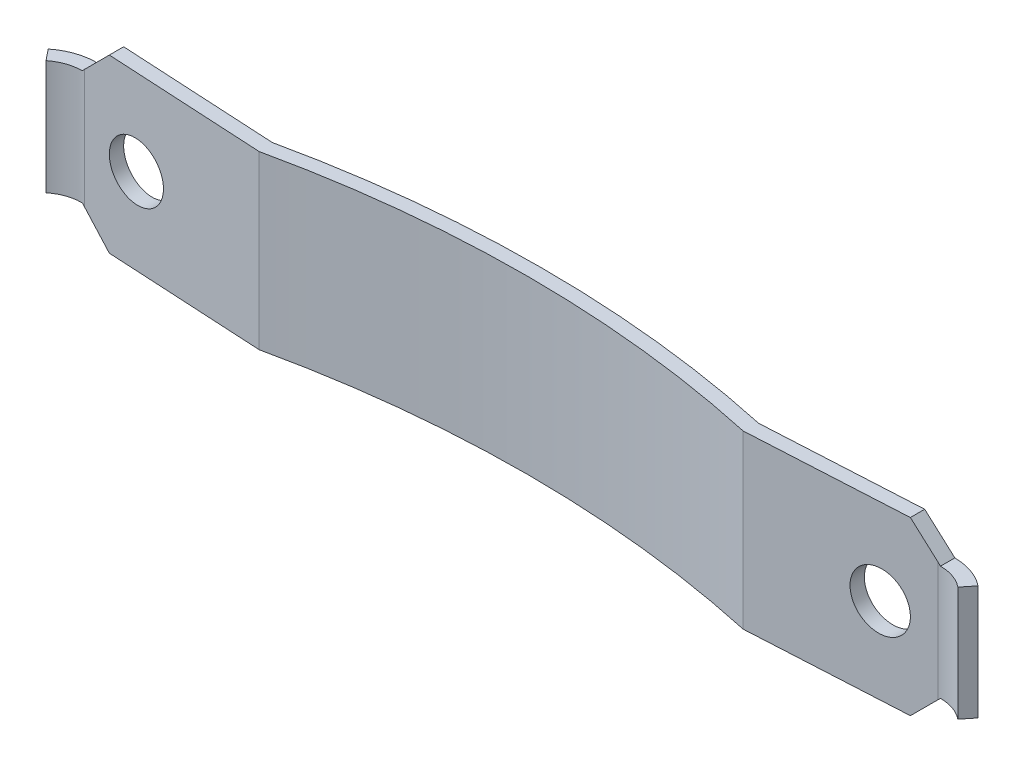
from build123d import *

# Parameters (mm, degrees)
EXTRU_MINCE1_DEPTH      = 3
ESQUISSE3_R             = 1
ENL_V_MAT_EXTRU_1_DEPTH = 3


with BuildPart() as part:
    # Esquisse2 → Extru.-Mince1 (new, symmetric)
    with BuildSketch(Plane(origin=(0, 0, 0), x_dir=(1, 0, 0), z_dir=(0, 1, 0))):
        with BuildLine():
            ThreePointArc((0, 1), (4.274476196, 0.770954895), (8.5, 0.086442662))
            Line((8.5, 0.086442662), (14.890841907, 0.435769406))
            ThreePointArc((14.890841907, 0.435769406), (15.610617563, 0.343257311), (16.25, 0))
            Line((16.25, 0), (15.9375, -0.390312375))
            ThreePointArc((15.9375, -0.390312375), (15.457963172, -0.132869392), (14.918131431, -0.06348532))
            Line((14.918131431, -0.06348532), (8.459582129, -0.416512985))
            ThreePointArc((8.459582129, -0.416512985), (4.254542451, 0.270203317), (0, 0.5))
            Line((0, 0.5), (0, 1))
        make_face()
    extru_mince1 = extrude(amount=EXTRU_MINCE1_DEPTH, both=True)

    # Sym_trie1: Extru.-Mince1 across plane
    add(extru_mince1.mirror(Plane(origin=(0, 0, 0), x_dir=(0, 0, 1), z_dir=(1, 0, 0))))

    # Esquisse3 → Enl_v. mat.-Extru.1 (cut, symmetric)
    with BuildSketch(Plane.XY):
        with Locations((-13, 0)):
            Circle(ESQUISSE3_R)
        with Locations(Location((13, 0, 0), (0, 0, 180))):
            Circle(ESQUISSE3_R)
        Polygon((-15, 2), (-14, 3), (-14, 3.758247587), (-18.901161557, 3.758247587), (-18.901161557, 2), align=None)
        Polygon((-14, -3), (-14, -3.758247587), (-18.901161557, -3.758247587), (-18.901161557, -2), (-15, -2), align=None)
        Polygon((15, -2), (14, -3), (14, -3.758247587), (18.901161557, -3.758247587), (18.901161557, -2), align=None)
        Polygon((14, 3), (14, 3.758247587), (18.901161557, 3.758247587), (18.901161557, 2), (15, 2), align=None)
    extrude(amount=ENL_V_MAT_EXTRU_1_DEPTH, both=True, mode=Mode.SUBTRACT)


solid = part.part
